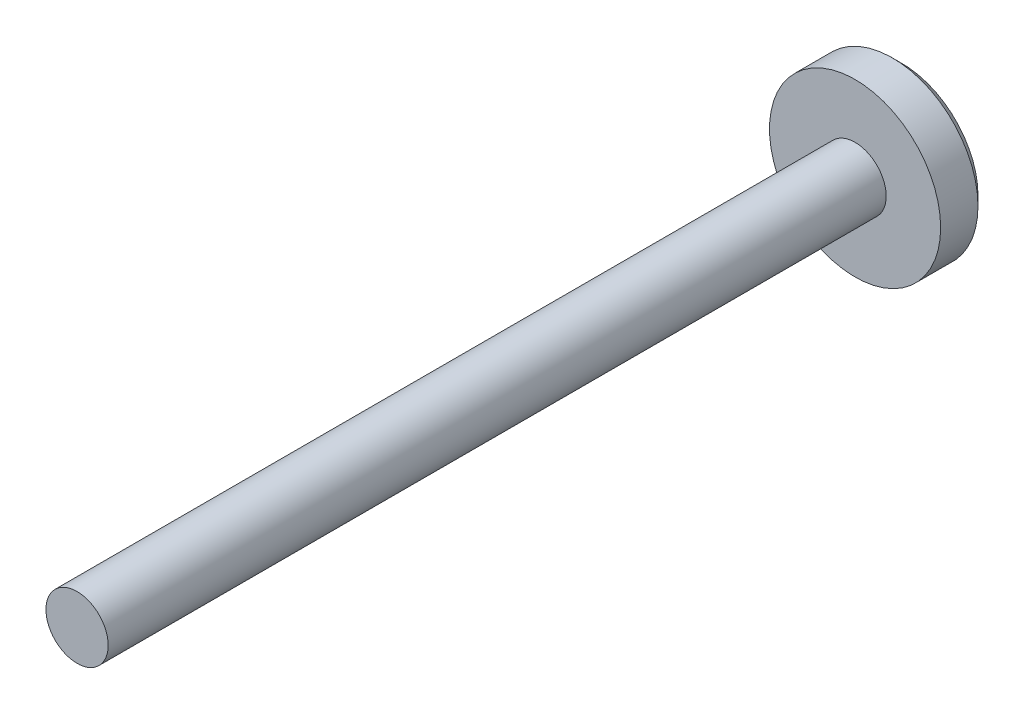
ISO-10303-21;
HEADER;
FILE_DESCRIPTION(('STEP AP214'),'2;1');
FILE_NAME('part.step','',(''),(''),'','','');
FILE_SCHEMA(('AUTOMOTIVE_DESIGN { 1 0 10303 214 1 1 1 1 }'));
ENDSEC;
DATA;
#1=APPLICATION_CONTEXT('core data for automotive mechanical design processes');
#2=APPLICATION_PROTOCOL_DEFINITION('international standard','automotive_design',2000,#1);
#3=PRODUCT_CONTEXT('',#1,'mechanical');
#4=PRODUCT('Part','Part','',(#3));
#5=PRODUCT_RELATED_PRODUCT_CATEGORY('part','',(#4));
#6=PRODUCT_DEFINITION_FORMATION('','',#4);
#7=PRODUCT_DEFINITION_CONTEXT('part definition',#1,'design');
#8=PRODUCT_DEFINITION('design','',#6,#7);
#9=PRODUCT_DEFINITION_SHAPE('','',#8);
#10=(LENGTH_UNIT() NAMED_UNIT(*) SI_UNIT(.MILLI.,.METRE.));
#11=(NAMED_UNIT(*) PLANE_ANGLE_UNIT() SI_UNIT($,.RADIAN.));
#12=(NAMED_UNIT(*) SI_UNIT($,.STERADIAN.) SOLID_ANGLE_UNIT());
#13=UNCERTAINTY_MEASURE_WITH_UNIT(LENGTH_MEASURE(1.E-05),#10,'distance_accuracy_value','');
#14=(GEOMETRIC_REPRESENTATION_CONTEXT(3) GLOBAL_UNCERTAINTY_ASSIGNED_CONTEXT((#13)) GLOBAL_UNIT_ASSIGNED_CONTEXT((#10,
#11,#12)) REPRESENTATION_CONTEXT('',''));
#15=CARTESIAN_POINT('',(0.,0.,0.));
#16=DIRECTION('',(0.,0.,1.));
#17=DIRECTION('',(1.,0.,0.));
#18=AXIS2_PLACEMENT_3D('',#15,#16,#17);
#19=CARTESIAN_POINT('',(0.,0.,15.));
#20=DIRECTION('',(0.,0.,1.));
#21=DIRECTION('',(1.,0.,0.));
#22=AXIS2_PLACEMENT_3D('',#19,#20,#21);
#23=PLANE('',#22);
#24=CARTESIAN_POINT('',(0.,0.,15.));
#25=DIRECTION('',(0.,0.,1.));
#26=DIRECTION('',(1.,0.,0.));
#27=AXIS2_PLACEMENT_3D('',#24,#25,#26);
#28=CIRCLE('',#27,27.5);
#29=CARTESIAN_POINT('',(27.5,0.,15.));
#30=VERTEX_POINT('',#29);
#31=EDGE_CURVE('E33',#30,#30,#28,.T.);
#32=ORIENTED_EDGE('',*,*,#31,.T.);
#33=EDGE_LOOP('',(#32));
#34=FACE_BOUND('',#33,.T.);
#35=CARTESIAN_POINT('',(0.,0.,15.));
#36=DIRECTION('',(0.,0.,1.));
#37=DIRECTION('',(1.,0.,0.));
#38=AXIS2_PLACEMENT_3D('',#35,#36,#37);
#39=CIRCLE('',#38,10.);
#40=CARTESIAN_POINT('',(10.,0.,15.));
#41=VERTEX_POINT('',#40);
#42=EDGE_CURVE('E42',#41,#41,#39,.T.);
#43=ORIENTED_EDGE('',*,*,#42,.F.);
#44=EDGE_LOOP('',(#43));
#45=FACE_BOUND('',#44,.T.);
#46=ADVANCED_FACE('F22',(#34,#45),#23,.T.);
#47=CARTESIAN_POINT('',(0.,0.,15.));
#48=DIRECTION('',(0.,0.,-1.));
#49=DIRECTION('',(-1.,0.,0.));
#50=AXIS2_PLACEMENT_3D('',#47,#48,#49);
#51=CYLINDRICAL_SURFACE('',#50,27.5);
#52=CARTESIAN_POINT('',(0.,0.,3.));
#53=DIRECTION('',(0.,0.,1.));
#54=DIRECTION('',(1.,0.,0.));
#55=AXIS2_PLACEMENT_3D('',#52,#53,#54);
#56=CIRCLE('',#55,27.5);
#57=CARTESIAN_POINT('',(27.5,0.,3.));
#58=VERTEX_POINT('',#57);
#59=EDGE_CURVE('E29',#58,#58,#56,.T.);
#60=ORIENTED_EDGE('',*,*,#59,.T.);
#61=EDGE_LOOP('',(#60));
#62=FACE_BOUND('',#61,.T.);
#63=ORIENTED_EDGE('',*,*,#31,.F.);
#64=EDGE_LOOP('',(#63));
#65=FACE_BOUND('',#64,.T.);
#66=ADVANCED_FACE('F24',(#62,#65),#51,.T.);
#67=CARTESIAN_POINT('',(0.,0.,0.));
#68=DIRECTION('',(0.,0.,1.));
#69=DIRECTION('',(1.,0.,0.));
#70=AXIS2_PLACEMENT_3D('',#67,#68,#69);
#71=PLANE('',#70);
#72=CARTESIAN_POINT('',(0.,0.,0.));
#73=DIRECTION('',(0.,0.,1.));
#74=DIRECTION('',(1.,0.,0.));
#75=AXIS2_PLACEMENT_3D('',#72,#73,#74);
#76=CIRCLE('',#75,24.5);
#77=CARTESIAN_POINT('',(24.5,0.,0.));
#78=VERTEX_POINT('',#77);
#79=EDGE_CURVE('E10',#78,#78,#76,.F.);
#80=ORIENTED_EDGE('',*,*,#79,.T.);
#81=EDGE_LOOP('',(#80));
#82=FACE_BOUND('',#81,.T.);
#83=ADVANCED_FACE('F53',(#82),#71,.F.);
#84=CARTESIAN_POINT('',(0.,0.,265.));
#85=DIRECTION('',(0.,0.,-1.));
#86=DIRECTION('',(-1.,0.,0.));
#87=AXIS2_PLACEMENT_3D('',#84,#85,#86);
#88=CYLINDRICAL_SURFACE('',#87,10.);
#89=CARTESIAN_POINT('',(0.,0.,265.));
#90=DIRECTION('',(0.,0.,1.));
#91=DIRECTION('',(1.,0.,0.));
#92=AXIS2_PLACEMENT_3D('',#89,#90,#91);
#93=CIRCLE('',#92,10.);
#94=CARTESIAN_POINT('',(10.,0.,265.));
#95=VERTEX_POINT('',#94);
#96=EDGE_CURVE('E37',#95,#95,#93,.T.);
#97=ORIENTED_EDGE('',*,*,#96,.F.);
#98=EDGE_LOOP('',(#97));
#99=FACE_BOUND('',#98,.T.);
#100=ORIENTED_EDGE('',*,*,#42,.T.);
#101=EDGE_LOOP('',(#100));
#102=FACE_BOUND('',#101,.T.);
#103=ADVANCED_FACE('F46',(#99,#102),#88,.T.);
#104=CARTESIAN_POINT('',(0.,0.,265.));
#105=DIRECTION('',(0.,0.,1.));
#106=DIRECTION('',(1.,0.,0.));
#107=AXIS2_PLACEMENT_3D('',#104,#105,#106);
#108=PLANE('',#107);
#109=ORIENTED_EDGE('',*,*,#96,.T.);
#110=EDGE_LOOP('',(#109));
#111=FACE_BOUND('',#110,.T.);
#112=ADVANCED_FACE('F59',(#111),#108,.T.);
#113=CARTESIAN_POINT('',(0.,0.,3.));
#114=DIRECTION('',(0.,0.,1.));
#115=DIRECTION('',(1.,0.,0.));
#116=AXIS2_PLACEMENT_3D('',#113,#114,#115);
#117=CONICAL_SURFACE('',#116,27.5,0.78539816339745);
#118=ORIENTED_EDGE('',*,*,#79,.F.);
#119=EDGE_LOOP('',(#118));
#120=FACE_BOUND('',#119,.T.);
#121=ORIENTED_EDGE('',*,*,#59,.F.);
#122=EDGE_LOOP('',(#121));
#123=FACE_BOUND('',#122,.T.);
#124=ADVANCED_FACE('F63',(#120,#123),#117,.T.);
#125=CLOSED_SHELL('',(#46,#66,#83,#103,#112,#124));
#126=MANIFOLD_SOLID_BREP('B2',#125);
#127=ADVANCED_BREP_SHAPE_REPRESENTATION('',(#18,#126),#14);
#128=SHAPE_DEFINITION_REPRESENTATION(#9,#127);
ENDSEC;
END-ISO-10303-21;
